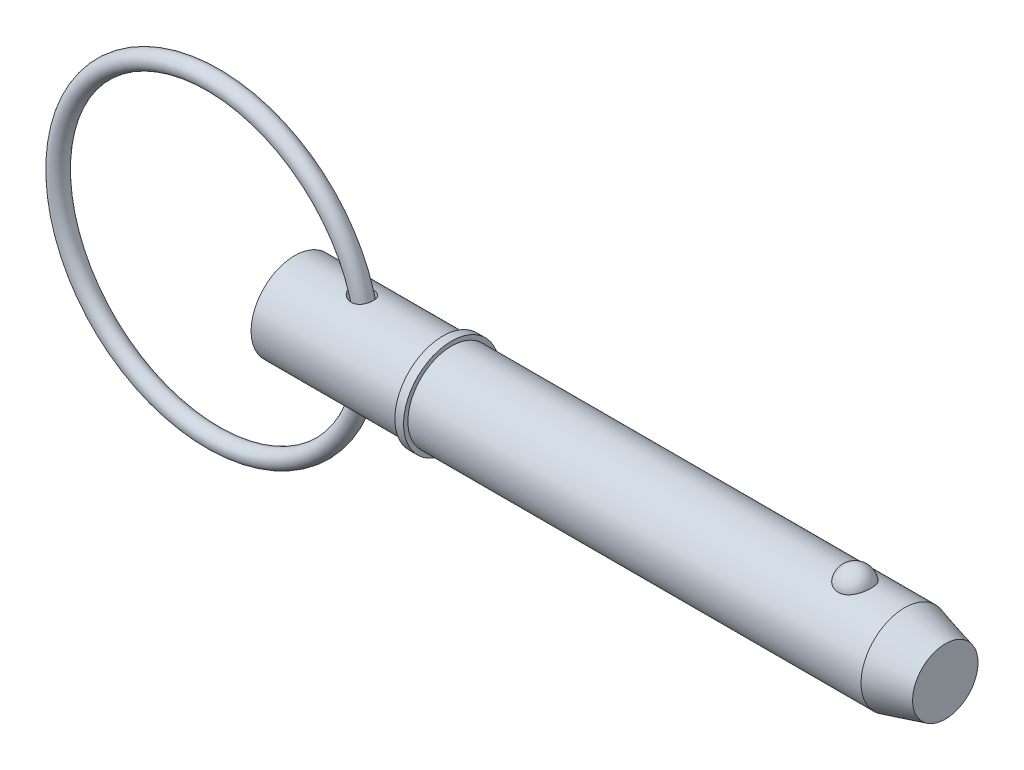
ISO-10303-21;
HEADER;
FILE_DESCRIPTION(('STEP AP214'),'2;1');
FILE_NAME('part.step','',(''),(''),'','','');
FILE_SCHEMA(('AUTOMOTIVE_DESIGN { 1 0 10303 214 1 1 1 1 }'));
ENDSEC;
DATA;
#1=APPLICATION_CONTEXT('core data for automotive mechanical design processes');
#2=APPLICATION_PROTOCOL_DEFINITION('international standard','automotive_design',2000,#1);
#3=PRODUCT_CONTEXT('',#1,'mechanical');
#4=PRODUCT('Part','Part','',(#3));
#5=PRODUCT_RELATED_PRODUCT_CATEGORY('part','',(#4));
#6=PRODUCT_DEFINITION_FORMATION('','',#4);
#7=PRODUCT_DEFINITION_CONTEXT('part definition',#1,'design');
#8=PRODUCT_DEFINITION('design','',#6,#7);
#9=PRODUCT_DEFINITION_SHAPE('','',#8);
#10=(LENGTH_UNIT() NAMED_UNIT(*) SI_UNIT(.MILLI.,.METRE.));
#11=(NAMED_UNIT(*) PLANE_ANGLE_UNIT() SI_UNIT($,.RADIAN.));
#12=(NAMED_UNIT(*) SI_UNIT($,.STERADIAN.) SOLID_ANGLE_UNIT());
#13=UNCERTAINTY_MEASURE_WITH_UNIT(LENGTH_MEASURE(1.E-05),#10,'distance_accuracy_value','');
#14=(GEOMETRIC_REPRESENTATION_CONTEXT(3) GLOBAL_UNCERTAINTY_ASSIGNED_CONTEXT((#13)) GLOBAL_UNIT_ASSIGNED_CONTEXT((#10,
#11,#12)) REPRESENTATION_CONTEXT('',''));
#15=CARTESIAN_POINT('',(0.,0.,0.));
#16=DIRECTION('',(0.,0.,1.));
#17=DIRECTION('',(1.,0.,0.));
#18=AXIS2_PLACEMENT_3D('',#15,#16,#17);
#19=CARTESIAN_POINT('',(-13.3805387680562,0.,0.));
#20=DIRECTION('',(0.,0.,1.));
#21=DIRECTION('',(1.,0.,0.));
#22=AXIS2_PLACEMENT_3D('',#19,#20,#21);
#23=TOROIDAL_SURFACE('',#22,25.4,1.429);
#24=CARTESIAN_POINT('',(13.4484612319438,0.,0.));
#25=VERTEX_POINT('',#24);
#26=VERTEX_LOOP('',#25);
#27=FACE_BOUND('',#26,.T.);
#28=ADVANCED_FACE('P0_F12',(#27),#23,.T.);
#29=CLOSED_SHELL('',(#28));
#30=MANIFOLD_SOLID_BREP('P0_B1',#29);
#31=CARTESIAN_POINT('',(0.,0.,0.));
#32=DIRECTION('',(1.,0.,0.));
#33=DIRECTION('',(0.,0.,-1.));
#34=AXIS2_PLACEMENT_3D('',#31,#32,#33);
#35=CYLINDRICAL_SURFACE('',#34,7.145);
#36=CARTESIAN_POINT('',(9.43029029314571,7.0820748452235,-0.94617170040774));
#37=CARTESIAN_POINT('',(9.49289741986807,7.07004660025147,-1.03619677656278));
#38=CARTESIAN_POINT('',(9.56370593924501,7.05703049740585,-1.12049617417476));
#39=CARTESIAN_POINT('',(9.71869321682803,7.03060933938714,-1.27585605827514));
#40=CARTESIAN_POINT('',(9.80290151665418,7.01720347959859,-1.34688652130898));
#41=CARTESIAN_POINT('',(9.98160385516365,6.99158714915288,-1.47408585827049));
#42=CARTESIAN_POINT('',(10.0760626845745,6.97937284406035,-1.53030346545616));
#43=CARTESIAN_POINT('',(10.2729508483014,6.95747410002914,-1.62697341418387));
#44=CARTESIAN_POINT('',(10.3753769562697,6.9477886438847,-1.66743209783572));
#45=CARTESIAN_POINT('',(10.5898946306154,6.93181594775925,-1.73266776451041));
#46=CARTESIAN_POINT('',(10.7022085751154,6.92567913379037,-1.75675727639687));
#47=CARTESIAN_POINT('',(10.9294935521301,6.91839634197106,-1.78523005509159));
#48=CARTESIAN_POINT('',(11.0444638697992,6.91724903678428,-1.78961856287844));
#49=CARTESIAN_POINT('',(11.2673249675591,6.92023954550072,-1.77801517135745));
#50=CARTESIAN_POINT('',(11.3752729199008,6.9241055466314,-1.7630715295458));
#51=CARTESIAN_POINT('',(11.5865707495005,6.93632220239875,-1.71437618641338));
#52=CARTESIAN_POINT('',(11.6899227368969,6.94467077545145,-1.68063321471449));
#53=CARTESIAN_POINT('',(11.8814537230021,6.96412118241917,-1.59802791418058));
#54=CARTESIAN_POINT('',(11.9701885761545,6.97498839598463,-1.55039425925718));
#55=CARTESIAN_POINT('',(12.1379548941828,6.99847346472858,-1.44066970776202));
#56=CARTESIAN_POINT('',(12.216987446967,7.01109112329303,-1.37858043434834));
#57=CARTESIAN_POINT('',(12.3614636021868,7.03632910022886,-1.24326778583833));
#58=CARTESIAN_POINT('',(12.4271729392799,7.04894297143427,-1.17032635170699));
#59=CARTESIAN_POINT('',(12.5455377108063,7.07306867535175,-1.01436746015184));
#60=CARTESIAN_POINT('',(12.5981928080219,7.08458047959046,-0.931349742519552));
#61=CARTESIAN_POINT('',(12.6896059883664,7.10535787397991,-0.756770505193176));
#62=CARTESIAN_POINT('',(12.7282356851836,7.11460247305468,-0.665139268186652));
#63=CARTESIAN_POINT('',(12.7900431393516,7.12971795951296,-0.476541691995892));
#64=CARTESIAN_POINT('',(12.8132203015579,7.13558871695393,-0.379575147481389));
#65=CARTESIAN_POINT('',(12.843715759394,7.14336270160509,-0.182249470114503));
#66=CARTESIAN_POINT('',(12.8509095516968,7.14523477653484,-0.081869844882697));
#67=CARTESIAN_POINT('',(12.8489064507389,7.14471772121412,0.118715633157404));
#68=CARTESIAN_POINT('',(12.8397092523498,7.14232851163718,0.218921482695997));
#69=CARTESIAN_POINT('',(12.8051110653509,7.13353949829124,0.41644658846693));
#70=CARTESIAN_POINT('',(12.7796895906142,7.12713462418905,0.513762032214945));
#71=CARTESIAN_POINT('',(12.7132079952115,7.1110024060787,0.702607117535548));
#72=CARTESIAN_POINT('',(12.6721476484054,7.10127501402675,0.79413667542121));
#73=CARTESIAN_POINT('',(12.5754142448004,7.07957648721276,0.968687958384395));
#74=CARTESIAN_POINT('',(12.5197583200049,7.06760798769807,1.05171950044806));
#75=CARTESIAN_POINT('',(12.3951873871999,7.04275315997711,1.20699878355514));
#76=CARTESIAN_POINT('',(12.3262733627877,7.02986689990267,1.27924732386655));
#77=CARTESIAN_POINT('',(12.1775943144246,7.00473797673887,1.41035599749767));
#78=CARTESIAN_POINT('',(12.0979195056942,6.99249102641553,1.46931758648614));
#79=CARTESIAN_POINT('',(11.9295314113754,6.96991222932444,1.57295053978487));
#80=CARTESIAN_POINT('',(11.840819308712,6.9595801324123,1.61762377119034));
#81=CARTESIAN_POINT('',(11.6577653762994,6.9420462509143,1.69128599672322));
#82=CARTESIAN_POINT('',(11.5634812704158,6.93481718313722,1.72041226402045));
#83=CARTESIAN_POINT('',(11.3712731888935,6.92407027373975,1.76316901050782));
#84=CARTESIAN_POINT('',(11.2733489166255,6.92055273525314,1.7767982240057));
#85=CARTESIAN_POINT('',(11.0745092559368,6.91745053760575,1.78883853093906));
#86=CARTESIAN_POINT('',(10.9735737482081,6.91794816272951,1.7869312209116));
#87=CARTESIAN_POINT('',(10.7732766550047,6.92286647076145,1.76777696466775));
#88=CARTESIAN_POINT('',(10.6739155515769,6.92728833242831,1.75052540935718));
#89=CARTESIAN_POINT('',(10.4726907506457,6.93987626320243,1.69995986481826));
#90=CARTESIAN_POINT('',(10.3710860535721,6.94826759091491,1.66567223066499));
#91=CARTESIAN_POINT('',(10.1746512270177,6.96783543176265,1.5818155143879));
#92=CARTESIAN_POINT('',(10.0798244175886,6.97901329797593,1.53223900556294));
#93=CARTESIAN_POINT('',(9.89353725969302,7.00369413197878,1.41530336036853));
#94=CARTESIAN_POINT('',(9.80266896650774,7.01729943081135,1.34701798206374));
#95=CARTESIAN_POINT('',(9.63408859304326,7.0446567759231,1.19571433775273));
#96=CARTESIAN_POINT('',(9.55637809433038,7.05840883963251,1.11269430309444));
#97=CARTESIAN_POINT('',(9.41909992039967,7.083998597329,0.935821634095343));
#98=CARTESIAN_POINT('',(9.35912834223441,7.09587546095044,0.842290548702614));
#99=CARTESIAN_POINT('',(9.25811978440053,7.11649414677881,0.645207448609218));
#100=CARTESIAN_POINT('',(9.21705789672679,7.12524008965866,0.541668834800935));
#101=CARTESIAN_POINT('',(9.16044503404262,7.13745944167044,0.341322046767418));
#102=CARTESIAN_POINT('',(9.14237352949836,7.14144984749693,0.245257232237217));
#103=CARTESIAN_POINT('',(9.12416132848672,7.14547143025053,0.0513577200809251));
#104=CARTESIAN_POINT('',(9.12401221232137,7.14550446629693,-0.0464761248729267));
#105=CARTESIAN_POINT('',(9.14075660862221,7.14180686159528,-0.230866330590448));
#106=CARTESIAN_POINT('',(9.15598246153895,7.13844450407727,-0.317588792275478));
#107=CARTESIAN_POINT('',(9.20015637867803,7.1288735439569,-0.487231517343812));
#108=CARTESIAN_POINT('',(9.22909411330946,7.12266708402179,-0.570154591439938));
#109=CARTESIAN_POINT('',(9.2869632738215,7.11060500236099,-0.702183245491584));
#110=CARTESIAN_POINT('',(9.3123377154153,7.10538970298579,-0.752949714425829));
#111=CARTESIAN_POINT('',(9.36784352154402,7.09422889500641,-0.851709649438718));
#112=CARTESIAN_POINT('',(9.39797435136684,7.08828346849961,-0.899703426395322));
#113=CARTESIAN_POINT('',(9.43029029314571,7.0820748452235,-0.94617170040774));
#114=B_SPLINE_CURVE_WITH_KNOTS('',3,(#36,#37,#38,#39,#40,#41,#42,#43,#44,#45,#46,#47,#48,#49,
#50,#51,#52,#53,#54,#55,#56,#57,#58,#59,#60,#61,#62,#63,#64,#65,#66,#67,#68,#69,#70,#71,#72,#73,
#74,#75,#76,#77,#78,#79,#80,#81,#82,#83,#84,#85,#86,#87,#88,#89,#90,#91,#92,#93,#94,#95,#96,#97,
#98,#99,#100,#101,#102,#103,#104,#105,#106,#107,#108,#109,#110,#111,#112,#113),.UNSPECIFIED.,
.T.,.F.,(4,2,2,2,2,2,2,2,2,2,2,2,2,2,2,2,2,2,2,2,2,2,2,2,2,2,2,2,2,2,2,2,2,2,2,2,2,2,4),(0.,
0.330712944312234,0.662165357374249,0.992513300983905,1.32272815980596,1.66607248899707,
2.00932547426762,2.33472339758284,2.65997034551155,2.96236844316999,3.26473260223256,
3.56029376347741,3.85586255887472,4.15407251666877,4.45229395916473,4.75283038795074,
5.05337241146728,5.35429467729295,5.6552212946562,5.95579625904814,6.25634893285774,
6.55452242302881,6.85265693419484,7.14811357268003,7.44359434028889,7.74514565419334,
8.04678757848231,8.36809025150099,8.68954924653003,9.03133562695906,9.37316306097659,
9.70647113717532,10.0393389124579,10.3311793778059,10.6228827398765,10.8860177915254,
11.1489549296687,11.3196783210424,11.4903825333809),.UNSPECIFIED.);
#115=CARTESIAN_POINT('',(9.43029029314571,7.0820748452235,-0.94617170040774));
#116=VERTEX_POINT('',#115);
#117=EDGE_CURVE('P1_E42',#116,#116,#114,.T.);
#118=ORIENTED_EDGE('',*,*,#117,.T.);
#119=EDGE_LOOP('',(#118));
#120=FACE_BOUND('',#119,.T.);
#121=CARTESIAN_POINT('',(0.,0.,0.));
#122=DIRECTION('',(1.,0.,0.));
#123=DIRECTION('',(0.,0.,-1.));
#124=AXIS2_PLACEMENT_3D('',#121,#122,#123);
#125=CIRCLE('',#124,7.145);
#126=CARTESIAN_POINT('',(0.,0.,-7.145));
#127=VERTEX_POINT('',#126);
#128=EDGE_CURVE('P1_E9',#127,#127,#125,.T.);
#129=ORIENTED_EDGE('',*,*,#128,.T.);
#130=EDGE_LOOP('',(#129));
#131=FACE_BOUND('',#130,.T.);
#132=CARTESIAN_POINT('',(24.271,0.,0.));
#133=DIRECTION('',(1.,0.,0.));
#134=DIRECTION('',(0.,0.,-1.));
#135=AXIS2_PLACEMENT_3D('',#132,#133,#134);
#136=CIRCLE('',#135,7.145);
#137=CARTESIAN_POINT('',(24.271,0.,-7.145));
#138=VERTEX_POINT('',#137);
#139=EDGE_CURVE('P1_E25',#138,#138,#136,.T.);
#140=ORIENTED_EDGE('',*,*,#139,.F.);
#141=EDGE_LOOP('',(#140));
#142=FACE_BOUND('',#141,.T.);
#143=CARTESIAN_POINT('',(9.43029029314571,-7.0820748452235,-0.94617170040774));
#144=CARTESIAN_POINT('',(9.37760063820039,-7.09219753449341,-0.870403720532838));
#145=CARTESIAN_POINT('',(9.33068640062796,-7.10162619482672,-0.790535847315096));
#146=CARTESIAN_POINT('',(9.25028000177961,-7.11818229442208,-0.624083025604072));
#147=CARTESIAN_POINT('',(9.21677847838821,-7.12531133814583,-0.53750281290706));
#148=CARTESIAN_POINT('',(9.16475883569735,-7.13651886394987,-0.359324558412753));
#149=CARTESIAN_POINT('',(9.14630423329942,-7.14058440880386,-0.267706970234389));
#150=CARTESIAN_POINT('',(9.12573334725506,-7.14512216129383,-0.082561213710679));
#151=CARTESIAN_POINT('',(9.12361335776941,-7.1455951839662,0.0109665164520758));
#152=CARTESIAN_POINT('',(9.13548667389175,-7.14296952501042,0.191627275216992));
#153=CARTESIAN_POINT('',(9.14858103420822,-7.14007009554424,0.278824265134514));
#154=CARTESIAN_POINT('',(9.18869656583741,-7.1313430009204,0.449782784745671));
#155=CARTESIAN_POINT('',(9.21571947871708,-7.1255149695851,0.533543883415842));
#156=CARTESIAN_POINT('',(9.282939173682,-7.11140544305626,0.696984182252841));
#157=CARTESIAN_POINT('',(9.32334793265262,-7.10308469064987,0.776572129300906));
#158=CARTESIAN_POINT('',(9.41555290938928,-7.08481187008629,0.928623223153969));
#159=CARTESIAN_POINT('',(9.4673531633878,-7.07485922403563,1.00108383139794));
#160=CARTESIAN_POINT('',(9.58690514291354,-7.05302654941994,1.14530893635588));
#161=CARTESIAN_POINT('',(9.65578345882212,-7.04105486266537,1.21612477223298));
#162=CARTESIAN_POINT('',(9.80342908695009,-7.01727063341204,1.34660507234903));
#163=CARTESIAN_POINT('',(9.88220203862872,-7.00545818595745,1.40626312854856));
#164=CARTESIAN_POINT('',(10.0573217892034,-6.9817739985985,1.51973713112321));
#165=CARTESIAN_POINT('',(10.1546474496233,-6.9700532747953,1.57208037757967));
#166=CARTESIAN_POINT('',(10.3567277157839,-6.94950828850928,1.66055104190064));
#167=CARTESIAN_POINT('',(10.4614845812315,-6.94068491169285,1.69667350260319));
#168=CARTESIAN_POINT('',(10.6792116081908,-6.92685379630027,1.75230777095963));
#169=CARTESIAN_POINT('',(10.7923373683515,-6.92197732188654,1.77125049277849));
#170=CARTESIAN_POINT('',(11.0202699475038,-6.91736328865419,1.78919210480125));
#171=CARTESIAN_POINT('',(11.1350759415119,-6.91762328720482,1.78820047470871));
#172=CARTESIAN_POINT('',(11.355627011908,-6.92328130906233,1.76615765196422));
#173=CARTESIAN_POINT('',(11.4615007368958,-6.92836826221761,1.74632083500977));
#174=CARTESIAN_POINT('',(11.6678083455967,-6.94272508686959,1.68833625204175));
#175=CARTESIAN_POINT('',(11.7682443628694,-6.9519933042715,1.65019572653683));
#176=CARTESIAN_POINT('',(11.9539217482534,-6.97285816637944,1.55957439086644));
#177=CARTESIAN_POINT('',(12.0397280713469,-6.98426147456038,1.50820229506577));
#178=CARTESIAN_POINT('',(12.2011249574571,-7.00842344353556,1.39160266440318));
#179=CARTESIAN_POINT('',(12.276716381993,-7.0211819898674,1.32637629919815));
#180=CARTESIAN_POINT('',(12.4144868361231,-7.04639315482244,1.18508369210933));
#181=CARTESIAN_POINT('',(12.4768620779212,-7.05884739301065,1.10920872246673));
#182=CARTESIAN_POINT('',(12.5881779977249,-7.08230185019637,0.947973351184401));
#183=CARTESIAN_POINT('',(12.6371182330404,-7.09330202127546,0.862612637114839));
#184=CARTESIAN_POINT('',(12.7208404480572,-7.11277016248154,0.683871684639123));
#185=CARTESIAN_POINT('',(12.7554736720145,-7.12121129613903,0.590418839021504));
#186=CARTESIAN_POINT('',(12.8090653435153,-7.13450309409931,0.398877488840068));
#187=CARTESIAN_POINT('',(12.8280232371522,-7.13935363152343,0.300788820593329));
#188=CARTESIAN_POINT('',(12.8499077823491,-7.14496695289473,0.102058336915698));
#189=CARTESIAN_POINT('',(12.8527265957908,-7.14570223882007,0.0014038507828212));
#190=CARTESIAN_POINT('',(12.8419792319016,-7.14293198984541,-0.198968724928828));
#191=CARTESIAN_POINT('',(12.8284127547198,-7.13942637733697,-0.298686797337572));
#192=CARTESIAN_POINT('',(12.7851853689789,-7.12854635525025,-0.494442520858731));
#193=CARTESIAN_POINT('',(12.7555107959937,-7.12116866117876,-0.590476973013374));
#194=CARTESIAN_POINT('',(12.6807437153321,-7.10334272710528,-0.776042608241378));
#195=CARTESIAN_POINT('',(12.6356510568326,-7.09289445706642,-0.865573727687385));
#196=CARTESIAN_POINT('',(12.5312128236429,-7.07009703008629,-1.03541867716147));
#197=CARTESIAN_POINT('',(12.4718917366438,-7.0577511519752,-1.11574799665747));
#198=CARTESIAN_POINT('',(12.3404461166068,-7.03252701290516,-1.26504204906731));
#199=CARTESIAN_POINT('',(12.2683227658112,-7.01964880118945,-1.33400783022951));
#200=CARTESIAN_POINT('',(12.1139052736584,-6.99493588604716,-1.45803732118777));
#201=CARTESIAN_POINT('',(12.031708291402,-6.98309284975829,-1.51322032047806));
#202=CARTESIAN_POINT('',(11.858962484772,-6.96164945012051,-1.60900039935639));
#203=CARTESIAN_POINT('',(11.7684146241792,-6.95204882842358,-1.6495991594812));
#204=CARTESIAN_POINT('',(11.5822744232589,-6.93618392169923,-1.71508374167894));
#205=CARTESIAN_POINT('',(11.4867225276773,-6.92989640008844,-1.74007923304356));
#206=CARTESIAN_POINT('',(11.292703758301,-6.92114809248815,-1.77455680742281));
#207=CARTESIAN_POINT('',(11.1942365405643,-6.91868775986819,-1.7840370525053));
#208=CARTESIAN_POINT('',(10.9943797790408,-6.91771041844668,-1.78782317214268));
#209=CARTESIAN_POINT('',(10.8929824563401,-6.9193005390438,-1.78171679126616));
#210=CARTESIAN_POINT('',(10.6924353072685,-6.92632816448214,-1.75419409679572));
#211=CARTESIAN_POINT('',(10.5932861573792,-6.93176681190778,-1.73277323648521));
#212=CARTESIAN_POINT('',(10.3927770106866,-6.94630717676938,-1.67356884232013));
#213=CARTESIAN_POINT('',(10.2917367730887,-6.95563581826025,-1.63475796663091));
#214=CARTESIAN_POINT('',(10.0971768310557,-6.97681957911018,-1.54184188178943));
#215=CARTESIAN_POINT('',(10.0036623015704,-6.9886764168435,-1.48772626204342));
#216=CARTESIAN_POINT('',(9.82098935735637,-7.01440230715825,-1.36146688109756));
#217=CARTESIAN_POINT('',(9.73247440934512,-7.0283510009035,-1.28840361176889));
#218=CARTESIAN_POINT('',(9.56978695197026,-7.05591334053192,-1.12770855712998));
#219=CARTESIAN_POINT('',(9.49560170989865,-7.06952727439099,-1.0400898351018));
#220=CARTESIAN_POINT('',(9.43029029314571,-7.0820748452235,-0.94617170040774));
#221=B_SPLINE_CURVE_WITH_KNOTS('',3,(#143,#144,#145,#146,#147,#148,#149,#150,#151,#152,#153,
#154,#155,#156,#157,#158,#159,#160,#161,#162,#163,#164,#165,#166,#167,#168,#169,#170,#171,#172,
#173,#174,#175,#176,#177,#178,#179,#180,#181,#182,#183,#184,#185,#186,#187,#188,#189,#190,#191,
#192,#193,#194,#195,#196,#197,#198,#199,#200,#201,#202,#203,#204,#205,#206,#207,#208,#209,#210,
#211,#212,#213,#214,#215,#216,#217,#218,#219,#220),.UNSPECIFIED.,.T.,.F.,(4,2,2,2,2,2,2,2,2,2,2,
2,2,2,2,2,2,2,2,2,2,2,2,2,2,2,2,2,2,2,2,2,2,2,2,2,2,2,4),(0.,0.278197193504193,
0.556199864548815,0.835370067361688,1.11447693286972,1.37789669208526,1.64134939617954,
1.90919123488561,2.17712812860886,2.47446254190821,2.77196719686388,3.10386520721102,
3.43586457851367,3.77849767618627,4.1209678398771,4.44276705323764,4.76443907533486,
5.0649452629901,5.36542609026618,5.66107282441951,5.95672929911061,6.25538683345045,
6.5540549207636,6.85471634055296,7.15538326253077,7.45630563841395,7.75723095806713,
8.05764204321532,8.35802540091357,8.65571107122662,8.95336242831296,9.24889743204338,
9.54446744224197,9.84793560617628,10.1514939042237,10.4760045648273,10.8007364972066,
11.1458836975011,11.4907227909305),.UNSPECIFIED.);
#222=CARTESIAN_POINT('',(9.43029029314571,-7.0820748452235,-0.94617170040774));
#223=VERTEX_POINT('',#222);
#224=EDGE_CURVE('P1_E17',#223,#223,#221,.T.);
#225=ORIENTED_EDGE('',*,*,#224,.T.);
#226=EDGE_LOOP('',(#225));
#227=FACE_BOUND('',#226,.T.);
#228=ADVANCED_FACE('P1_F13',(#120,#131,#142,#227),#35,.T.);
#229=CARTESIAN_POINT('',(0.,0.,0.));
#230=DIRECTION('',(1.,0.,0.));
#231=DIRECTION('',(0.,0.,-1.));
#232=AXIS2_PLACEMENT_3D('',#229,#230,#231);
#233=CYLINDRICAL_SURFACE('',#232,7.145);
#234=CARTESIAN_POINT('',(99.9836242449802,0.,0.));
#235=DIRECTION('',(1.,0.,0.));
#236=DIRECTION('',(0.,0.,-1.));
#237=AXIS2_PLACEMENT_3D('',#234,#235,#236);
#238=CIRCLE('',#237,7.145);
#239=CARTESIAN_POINT('',(99.9836242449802,0.,-7.145));
#240=VERTEX_POINT('',#239);
#241=EDGE_CURVE('P1_E99',#240,#240,#238,.T.);
#242=ORIENTED_EDGE('',*,*,#241,.F.);
#243=EDGE_LOOP('',(#242));
#244=FACE_BOUND('',#243,.T.);
#245=CARTESIAN_POINT('',(25.7,0.,0.));
#246=DIRECTION('',(1.,0.,0.));
#247=DIRECTION('',(0.,0.,-1.));
#248=AXIS2_PLACEMENT_3D('',#245,#246,#247);
#249=CIRCLE('',#248,7.145);
#250=CARTESIAN_POINT('',(25.7,0.,-7.145));
#251=VERTEX_POINT('',#250);
#252=EDGE_CURVE('P1_E96',#251,#251,#249,.T.);
#253=ORIENTED_EDGE('',*,*,#252,.T.);
#254=EDGE_LOOP('',(#253));
#255=FACE_BOUND('',#254,.T.);
#256=CARTESIAN_POINT('',(91.8395037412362,6.60328629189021,2.72903557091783));
#257=CARTESIAN_POINT('',(91.698315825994,6.60329644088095,2.7290249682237));
#258=CARTESIAN_POINT('',(91.5568832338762,6.60799490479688,2.71772840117));
#259=CARTESIAN_POINT('',(91.2779557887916,6.62628236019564,2.6728193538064));
#260=CARTESIAN_POINT('',(91.1404726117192,6.63989534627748,2.63914664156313));
#261=CARTESIAN_POINT('',(90.8738894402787,6.67440775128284,2.55059642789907));
#262=CARTESIAN_POINT('',(90.7447683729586,6.69528793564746,2.49577486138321));
#263=CARTESIAN_POINT('',(90.4978694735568,6.74205585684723,2.36651799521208));
#264=CARTESIAN_POINT('',(90.3800865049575,6.76794130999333,2.29209163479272));
#265=CARTESIAN_POINT('',(90.1551671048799,6.82286177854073,2.12312937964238));
#266=CARTESIAN_POINT('',(90.0484405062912,6.85196655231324,2.02807107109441));
#267=CARTESIAN_POINT('',(89.8519181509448,6.90970232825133,1.82167822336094));
#268=CARTESIAN_POINT('',(89.7621276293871,6.93833318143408,1.71033867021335));
#269=CARTESIAN_POINT('',(89.5976670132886,6.9935167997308,1.46891951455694));
#270=CARTESIAN_POINT('',(89.523844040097,7.01992110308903,1.33822781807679));
#271=CARTESIAN_POINT('',(89.3980884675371,7.06643385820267,1.0656656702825));
#272=CARTESIAN_POINT('',(89.3461573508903,7.08654188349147,0.92379446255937));
#273=CARTESIAN_POINT('',(89.2647323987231,7.11862399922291,0.630993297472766));
#274=CARTESIAN_POINT('',(89.2355167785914,7.13049704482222,0.479974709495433));
#275=CARTESIAN_POINT('',(89.2011742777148,7.14449484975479,0.174782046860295));
#276=CARTESIAN_POINT('',(89.1960466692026,7.14661990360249,0.0206080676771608));
#277=CARTESIAN_POINT('',(89.209938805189,7.14092465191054,-0.285506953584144));
#278=CARTESIAN_POINT('',(89.2288101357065,7.1331654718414,-0.437455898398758));
#279=CARTESIAN_POINT('',(89.2900622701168,7.10859076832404,-0.735778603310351));
#280=CARTESIAN_POINT('',(89.3324435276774,7.0917750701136,-0.882152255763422));
#281=CARTESIAN_POINT('',(89.4399346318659,7.05076716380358,-1.16543149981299));
#282=CARTESIAN_POINT('',(89.5050759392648,7.02656475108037,-1.30232366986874));
#283=CARTESIAN_POINT('',(89.6567597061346,6.97329145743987,-1.56265907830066));
#284=CARTESIAN_POINT('',(89.7433039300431,6.94422017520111,-1.68610120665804));
#285=CARTESIAN_POINT('',(89.9364654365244,6.88415108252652,-1.91671004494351));
#286=CARTESIAN_POINT('',(90.0431807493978,6.85314438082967,-2.02379244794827));
#287=CARTESIAN_POINT('',(90.2739740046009,6.79282069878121,-2.21787433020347));
#288=CARTESIAN_POINT('',(90.398050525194,6.76350358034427,-2.30487545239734));
#289=CARTESIAN_POINT('',(90.6576784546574,6.71060580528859,-2.45458647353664));
#290=CARTESIAN_POINT('',(90.7929387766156,6.68691885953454,-2.51776240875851));
#291=CARTESIAN_POINT('',(91.0732778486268,6.64741247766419,-2.62030218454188));
#292=CARTESIAN_POINT('',(91.218352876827,6.63159007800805,-2.65967499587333));
#293=CARTESIAN_POINT('',(91.5063475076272,6.61038594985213,-2.71193301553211));
#294=CARTESIAN_POINT('',(91.6490080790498,6.60451880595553,-2.72605165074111));
#295=CARTESIAN_POINT('',(91.9348004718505,6.60240611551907,-2.73116688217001));
#296=CARTESIAN_POINT('',(92.0779321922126,6.60615862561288,-2.7221681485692));
#297=CARTESIAN_POINT('',(92.3558486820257,6.6225609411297,-2.68200435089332));
#298=CARTESIAN_POINT('',(92.4907542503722,6.63492533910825,-2.65154998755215));
#299=CARTESIAN_POINT('',(92.75332009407,6.66687445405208,-2.57015684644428));
#300=CARTESIAN_POINT('',(92.8809797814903,6.68645975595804,-2.51921640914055));
#301=CARTESIAN_POINT('',(93.1285777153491,6.73127274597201,-2.39693610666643));
#302=CARTESIAN_POINT('',(93.248287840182,6.7566138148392,-2.32517694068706));
#303=CARTESIAN_POINT('',(93.4741592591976,6.8100600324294,-2.1636381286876));
#304=CARTESIAN_POINT('',(93.580317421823,6.83816581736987,-2.07385432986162));
#305=CARTESIAN_POINT('',(93.7818620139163,6.8958046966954,-1.87357235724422));
#306=CARTESIAN_POINT('',(93.876440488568,6.92533863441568,-1.76226074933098));
#307=CARTESIAN_POINT('',(94.0463329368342,6.98139526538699,-1.52511696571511));
#308=CARTESIAN_POINT('',(94.1216434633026,7.0079174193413,-1.39928219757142));
#309=CARTESIAN_POINT('',(94.253595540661,7.05607625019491,-1.1321597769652));
#310=CARTESIAN_POINT('',(94.3095688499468,7.07753119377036,-0.990508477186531));
#311=CARTESIAN_POINT('',(94.3982965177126,7.11222355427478,-0.699154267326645));
#312=CARTESIAN_POINT('',(94.4310506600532,7.12546089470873,-0.549451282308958));
#313=CARTESIAN_POINT('',(94.4726899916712,7.14237584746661,-0.246120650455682));
#314=CARTESIAN_POINT('',(94.481558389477,7.14604673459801,-0.0924903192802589));
#315=CARTESIAN_POINT('',(94.4751940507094,7.14343510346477,0.214181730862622));
#316=CARTESIAN_POINT('',(94.4599618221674,7.13715279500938,0.367223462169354));
#317=CARTESIAN_POINT('',(94.4058451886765,7.1153294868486,0.667595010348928));
#318=CARTESIAN_POINT('',(94.3670776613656,7.09983424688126,0.814949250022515));
#319=CARTESIAN_POINT('',(94.2667700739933,7.06119140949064,1.10063221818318));
#320=CARTESIAN_POINT('',(94.2052284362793,7.03804328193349,1.238960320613));
#321=CARTESIAN_POINT('',(94.0602071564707,6.98632429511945,1.50352300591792));
#322=CARTESIAN_POINT('',(93.9766067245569,6.95772382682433,1.62968561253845));
#323=CARTESIAN_POINT('',(93.7893804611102,6.89823072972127,1.86554304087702));
#324=CARTESIAN_POINT('',(93.6857557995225,6.86733823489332,1.97523882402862));
#325=CARTESIAN_POINT('',(93.4610769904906,6.80676456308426,2.17482293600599));
#326=CARTESIAN_POINT('',(93.3400673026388,6.7770805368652,2.26476035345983));
#327=CARTESIAN_POINT('',(93.0833408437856,6.7223050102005,2.42252989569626));
#328=CARTESIAN_POINT('',(92.94761851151,6.69721525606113,2.4903536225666));
#329=CARTESIAN_POINT('',(92.6704022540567,6.65552591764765,2.59967646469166));
#330=CARTESIAN_POINT('',(92.5292810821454,6.63865794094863,2.64202017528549));
#331=CARTESIAN_POINT('',(92.2414448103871,6.61425039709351,2.70255841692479));
#332=CARTESIAN_POINT('',(92.0947480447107,6.606682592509,2.72082606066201));
#333=CARTESIAN_POINT('',(91.9116799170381,6.60358754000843,2.72830331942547));
#334=CARTESIAN_POINT('',(91.8755998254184,6.60328369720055,2.72903828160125));
#335=CARTESIAN_POINT('',(91.8395037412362,6.60328629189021,2.72903557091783));
#336=B_SPLINE_CURVE_WITH_KNOTS('',3,(#256,#257,#258,#259,#260,#261,#262,#263,#264,#265,#266,
#267,#268,#269,#270,#271,#272,#273,#274,#275,#276,#277,#278,#279,#280,#281,#282,#283,#284,#285,
#286,#287,#288,#289,#290,#291,#292,#293,#294,#295,#296,#297,#298,#299,#300,#301,#302,#303,#304,
#305,#306,#307,#308,#309,#310,#311,#312,#313,#314,#315,#316,#317,#318,#319,#320,#321,#322,#323,
#324,#325,#326,#327,#328,#329,#330,#331,#332,#333,#334,#335),.UNSPECIFIED.,.T.,.F.,(4,2,2,2,2,2,
2,2,2,2,2,2,2,2,2,2,2,2,2,2,2,2,2,2,2,2,2,2,2,2,2,2,2,2,2,2,2,2,2,4),(0.,0.423468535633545,
0.848081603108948,1.27157926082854,1.69488414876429,2.13051395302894,2.56627819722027,
3.02136706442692,3.47648674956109,3.93709649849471,4.39769233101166,4.85545355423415,
5.31322361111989,5.77162895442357,6.23007210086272,6.69080337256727,7.15149693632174,
7.60264329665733,8.05361952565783,8.48189729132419,8.91008854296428,9.32472524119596,
9.7393955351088,10.1630783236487,10.5868588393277,11.0319070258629,11.4770347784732,
11.9362874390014,12.3955443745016,12.8551240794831,13.3146940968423,13.7720003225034,
14.2293382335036,14.6892343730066,15.1491036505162,15.6078171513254,16.0667046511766,
16.5093965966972,16.9507410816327,17.0590049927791),.UNSPECIFIED.);
#337=CARTESIAN_POINT('',(91.8395037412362,6.60328629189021,2.72903557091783));
#338=VERTEX_POINT('',#337);
#339=EDGE_CURVE('P1_E34',#338,#338,#336,.T.);
#340=ORIENTED_EDGE('',*,*,#339,.T.);
#341=EDGE_LOOP('',(#340));
#342=FACE_BOUND('',#341,.T.);
#343=ADVANCED_FACE('P1_F46',(#244,#255,#342),#233,.T.);
#344=CARTESIAN_POINT('',(0.,0.,0.));
#345=DIRECTION('',(-1.,0.,0.));
#346=DIRECTION('',(0.,0.,1.));
#347=AXIS2_PLACEMENT_3D('',#344,#345,#346);
#348=PLANE('',#347);
#349=ORIENTED_EDGE('',*,*,#128,.F.);
#350=EDGE_LOOP('',(#349));
#351=FACE_BOUND('',#350,.T.);
#352=ADVANCED_FACE('P1_F15',(#351),#348,.T.);
#353=CARTESIAN_POINT('',(24.271,7.145,0.));
#354=DIRECTION('',(-1.,0.,0.));
#355=DIRECTION('',(0.,0.,1.));
#356=AXIS2_PLACEMENT_3D('',#353,#354,#355);
#357=PLANE('',#356);
#358=ORIENTED_EDGE('',*,*,#139,.T.);
#359=EDGE_LOOP('',(#358));
#360=FACE_BOUND('',#359,.T.);
#361=CARTESIAN_POINT('',(24.271,0.,0.));
#362=DIRECTION('',(1.,0.,0.));
#363=DIRECTION('',(0.,0.,-1.));
#364=AXIS2_PLACEMENT_3D('',#361,#362,#363);
#365=CIRCLE('',#364,7.8595);
#366=CARTESIAN_POINT('',(24.271,0.,-7.8595));
#367=VERTEX_POINT('',#366);
#368=EDGE_CURVE('P1_E30',#367,#367,#365,.T.);
#369=ORIENTED_EDGE('',*,*,#368,.F.);
#370=EDGE_LOOP('',(#369));
#371=FACE_BOUND('',#370,.T.);
#372=ADVANCED_FACE('P1_F81',(#360,#371),#357,.T.);
#373=CARTESIAN_POINT('',(0.,0.,0.));
#374=DIRECTION('',(1.,0.,0.));
#375=DIRECTION('',(0.,0.,-1.));
#376=AXIS2_PLACEMENT_3D('',#373,#374,#375);
#377=CYLINDRICAL_SURFACE('',#376,7.8595);
#378=ORIENTED_EDGE('',*,*,#368,.T.);
#379=EDGE_LOOP('',(#378));
#380=FACE_BOUND('',#379,.T.);
#381=CARTESIAN_POINT('',(25.7,0.,0.));
#382=DIRECTION('',(1.,0.,0.));
#383=DIRECTION('',(0.,0.,-1.));
#384=AXIS2_PLACEMENT_3D('',#381,#382,#383);
#385=CIRCLE('',#384,7.8595);
#386=CARTESIAN_POINT('',(25.7,0.,-7.8595));
#387=VERTEX_POINT('',#386);
#388=EDGE_CURVE('P1_E95',#387,#387,#385,.T.);
#389=ORIENTED_EDGE('',*,*,#388,.F.);
#390=EDGE_LOOP('',(#389));
#391=FACE_BOUND('',#390,.T.);
#392=ADVANCED_FACE('P1_F68',(#380,#391),#377,.T.);
#393=CARTESIAN_POINT('',(25.7,7.8595,0.));
#394=DIRECTION('',(1.,0.,0.));
#395=DIRECTION('',(0.,0.,-1.));
#396=AXIS2_PLACEMENT_3D('',#393,#394,#395);
#397=PLANE('',#396);
#398=ORIENTED_EDGE('',*,*,#388,.T.);
#399=EDGE_LOOP('',(#398));
#400=FACE_BOUND('',#399,.T.);
#401=ORIENTED_EDGE('',*,*,#252,.F.);
#402=EDGE_LOOP('',(#401));
#403=FACE_BOUND('',#402,.T.);
#404=ADVANCED_FACE('P1_F62',(#400,#403),#397,.T.);
#405=CARTESIAN_POINT('',(106.65,0.,0.));
#406=DIRECTION('',(-1.,0.,0.));
#407=DIRECTION('',(0.,0.,1.));
#408=AXIS2_PLACEMENT_3D('',#405,#406,#407);
#409=CONICAL_SURFACE('',#408,5.35875000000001,0.26179938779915);
#410=ORIENTED_EDGE('',*,*,#241,.T.);
#411=EDGE_LOOP('',(#410));
#412=FACE_BOUND('',#411,.T.);
#413=CARTESIAN_POINT('',(106.65,0.,0.));
#414=DIRECTION('',(1.,0.,0.));
#415=DIRECTION('',(0.,0.,-1.));
#416=AXIS2_PLACEMENT_3D('',#413,#414,#415);
#417=CIRCLE('',#416,5.35875000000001);
#418=CARTESIAN_POINT('',(106.65,0.,-5.35875000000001));
#419=VERTEX_POINT('',#418);
#420=EDGE_CURVE('P1_E41',#419,#419,#417,.T.);
#421=ORIENTED_EDGE('',*,*,#420,.F.);
#422=EDGE_LOOP('',(#421));
#423=FACE_BOUND('',#422,.T.);
#424=ADVANCED_FACE('P1_F59',(#412,#423),#409,.T.);
#425=CARTESIAN_POINT('',(106.65,5.35875000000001,0.));
#426=DIRECTION('',(1.,0.,0.));
#427=DIRECTION('',(0.,0.,-1.));
#428=AXIS2_PLACEMENT_3D('',#425,#426,#427);
#429=PLANE('',#428);
#430=ORIENTED_EDGE('',*,*,#420,.T.);
#431=EDGE_LOOP('',(#430));
#432=FACE_BOUND('',#431,.T.);
#433=ADVANCED_FACE('P1_F55',(#432),#429,.T.);
#434=CARTESIAN_POINT('',(91.8395037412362,6.43049999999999,0.));
#435=DIRECTION('',(-1.,0.,0.));
#436=DIRECTION('',(0.,1.,0.));
#437=AXIS2_PLACEMENT_3D('',#434,#435,#436);
#438=SPHERICAL_SURFACE('',#437,2.7345);
#439=ORIENTED_EDGE('',*,*,#339,.F.);
#440=EDGE_LOOP('',(#439));
#441=FACE_BOUND('',#440,.T.);
#442=ADVANCED_FACE('P1_F50',(#441),#438,.T.);
#443=CARTESIAN_POINT('',(-13.3805387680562,0.,0.));
#444=DIRECTION('',(0.,0.,1.));
#445=DIRECTION('',(1.,0.,0.));
#446=AXIS2_PLACEMENT_3D('',#443,#444,#445);
#447=TOROIDAL_SURFACE('',#446,25.4,1.78625);
#448=ORIENTED_EDGE('',*,*,#224,.F.);
#449=EDGE_LOOP('',(#448));
#450=FACE_BOUND('',#449,.T.);
#451=ORIENTED_EDGE('',*,*,#117,.F.);
#452=EDGE_LOOP('',(#451));
#453=FACE_BOUND('',#452,.T.);
#454=ADVANCED_FACE('P1_F54',(#450,#453),#447,.F.);
#455=CLOSED_SHELL('',(#228,#343,#352,#372,#392,#404,#424,#433,#442,#454));
#456=MANIFOLD_SOLID_BREP('P1_B1',#455);
#457=ADVANCED_BREP_SHAPE_REPRESENTATION('',(#18,#30,#456),#14);
#458=SHAPE_DEFINITION_REPRESENTATION(#9,#457);
ENDSEC;
END-ISO-10303-21;
